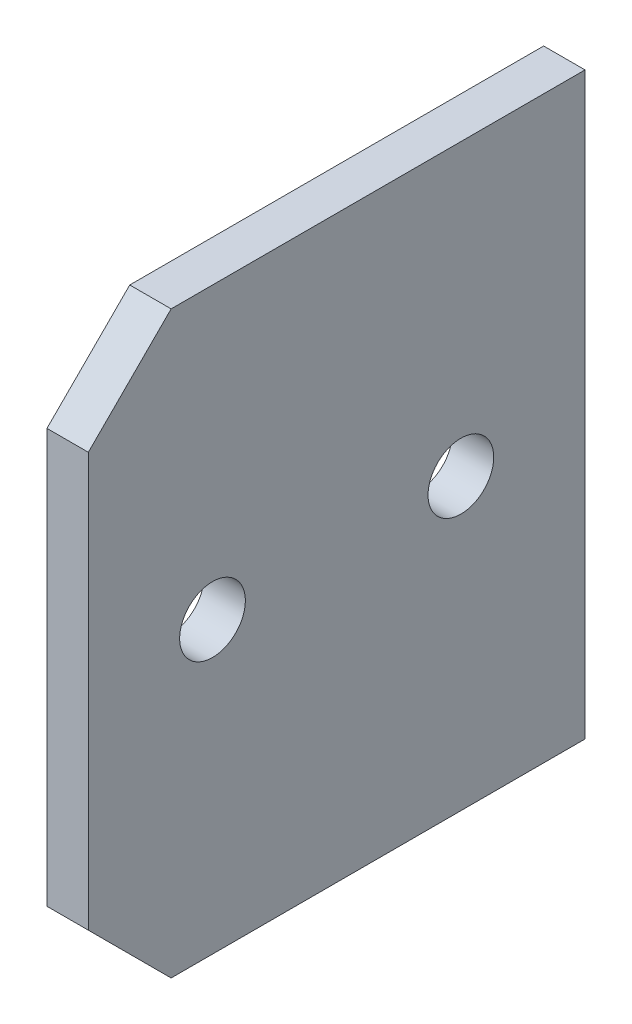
ISO-10303-21;
HEADER;
FILE_DESCRIPTION(('STEP AP214'),'2;1');
FILE_NAME('part.step','',(''),(''),'','','');
FILE_SCHEMA(('AUTOMOTIVE_DESIGN { 1 0 10303 214 1 1 1 1 }'));
ENDSEC;
DATA;
#1=APPLICATION_CONTEXT('core data for automotive mechanical design processes');
#2=APPLICATION_PROTOCOL_DEFINITION('international standard','automotive_design',2000,#1);
#3=PRODUCT_CONTEXT('',#1,'mechanical');
#4=PRODUCT('Part','Part','',(#3));
#5=PRODUCT_RELATED_PRODUCT_CATEGORY('part','',(#4));
#6=PRODUCT_DEFINITION_FORMATION('','',#4);
#7=PRODUCT_DEFINITION_CONTEXT('part definition',#1,'design');
#8=PRODUCT_DEFINITION('design','',#6,#7);
#9=PRODUCT_DEFINITION_SHAPE('','',#8);
#10=(LENGTH_UNIT() NAMED_UNIT(*) SI_UNIT(.MILLI.,.METRE.));
#11=(NAMED_UNIT(*) PLANE_ANGLE_UNIT() SI_UNIT($,.RADIAN.));
#12=(NAMED_UNIT(*) SI_UNIT($,.STERADIAN.) SOLID_ANGLE_UNIT());
#13=UNCERTAINTY_MEASURE_WITH_UNIT(LENGTH_MEASURE(1.E-05),#10,'distance_accuracy_value','');
#14=(GEOMETRIC_REPRESENTATION_CONTEXT(3) GLOBAL_UNCERTAINTY_ASSIGNED_CONTEXT((#13)) GLOBAL_UNIT_ASSIGNED_CONTEXT((#10,
#11,#12)) REPRESENTATION_CONTEXT('',''));
#15=CARTESIAN_POINT('',(0.,0.,0.));
#16=DIRECTION('',(0.,0.,1.));
#17=DIRECTION('',(1.,0.,0.));
#18=AXIS2_PLACEMENT_3D('',#15,#16,#17);
#19=CARTESIAN_POINT('',(-3.175,-44.45,76.2));
#20=DIRECTION('',(0.,1.,0.));
#21=DIRECTION('',(-1.,0.,0.));
#22=AXIS2_PLACEMENT_3D('',#19,#20,#21);
#23=PLANE('',#22);
#24=DIRECTION('',(0.,0.,-1.));
#25=VECTOR('',#24,1.);
#26=CARTESIAN_POINT('',(3.175,-44.45,76.2));
#27=LINE('',#26,#25);
#28=CARTESIAN_POINT('',(3.175,-44.45,63.4999999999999));
#29=VERTEX_POINT('',#28);
#30=CARTESIAN_POINT('',(3.175,-44.45,0.));
#31=VERTEX_POINT('',#30);
#32=EDGE_CURVE('E81',#29,#31,#27,.T.);
#33=ORIENTED_EDGE('',*,*,#32,.F.);
#34=DIRECTION('',(-1.,0.,0.));
#35=VECTOR('',#34,1.);
#36=CARTESIAN_POINT('',(-3.175,-44.45,63.4999999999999));
#37=LINE('',#36,#35);
#38=CARTESIAN_POINT('',(-3.175,-44.45,63.4999999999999));
#39=VERTEX_POINT('',#38);
#40=EDGE_CURVE('E11',#29,#39,#37,.T.);
#41=ORIENTED_EDGE('',*,*,#40,.T.);
#42=DIRECTION('',(0.,0.,-1.));
#43=VECTOR('',#42,1.);
#44=CARTESIAN_POINT('',(-3.175,-44.45,76.2));
#45=LINE('',#44,#43);
#46=CARTESIAN_POINT('',(-3.175,-44.45,0.));
#47=VERTEX_POINT('',#46);
#48=EDGE_CURVE('E101',#39,#47,#45,.T.);
#49=ORIENTED_EDGE('',*,*,#48,.T.);
#50=DIRECTION('',(1.,0.,0.));
#51=VECTOR('',#50,1.);
#52=CARTESIAN_POINT('',(-3.175,-44.45,0.));
#53=LINE('',#52,#51);
#54=EDGE_CURVE('E96',#47,#31,#53,.T.);
#55=ORIENTED_EDGE('',*,*,#54,.T.);
#56=EDGE_LOOP('',(#33,#41,#49,#55));
#57=FACE_BOUND('',#56,.T.);
#58=ADVANCED_FACE('F31',(#57),#23,.F.);
#59=CARTESIAN_POINT('',(3.175,-44.45,76.2));
#60=DIRECTION('',(-1.,0.,0.));
#61=DIRECTION('',(0.,0.,1.));
#62=AXIS2_PLACEMENT_3D('',#59,#60,#61);
#63=PLANE('',#62);
#64=CARTESIAN_POINT('',(3.175,0.,57.1500000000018));
#65=DIRECTION('',(1.,0.,0.));
#66=DIRECTION('',(0.,0.,-1.));
#67=AXIS2_PLACEMENT_3D('',#64,#65,#66);
#68=CIRCLE('',#67,5.0419);
#69=CARTESIAN_POINT('',(3.175,0.,52.1081000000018));
#70=VERTEX_POINT('',#69);
#71=EDGE_CURVE('E186',#70,#70,#68,.T.);
#72=ORIENTED_EDGE('',*,*,#71,.F.);
#73=EDGE_LOOP('',(#72));
#74=FACE_BOUND('',#73,.T.);
#75=CARTESIAN_POINT('',(3.175,0.,19.0500000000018));
#76=DIRECTION('',(1.,0.,0.));
#77=DIRECTION('',(0.,0.,-1.));
#78=AXIS2_PLACEMENT_3D('',#75,#76,#77);
#79=CIRCLE('',#78,5.0419);
#80=CARTESIAN_POINT('',(3.175,0.,14.0081000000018));
#81=VERTEX_POINT('',#80);
#82=EDGE_CURVE('E106',#81,#81,#79,.T.);
#83=ORIENTED_EDGE('',*,*,#82,.F.);
#84=EDGE_LOOP('',(#83));
#85=FACE_BOUND('',#84,.T.);
#86=DIRECTION('',(0.,0.,-1.));
#87=VECTOR('',#86,1.);
#88=CARTESIAN_POINT('',(3.175,44.45,76.2));
#89=LINE('',#88,#87);
#90=CARTESIAN_POINT('',(3.175,44.45,63.4999999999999));
#91=VERTEX_POINT('',#90);
#92=CARTESIAN_POINT('',(3.175,44.45,0.));
#93=VERTEX_POINT('',#92);
#94=EDGE_CURVE('E90',#91,#93,#89,.T.);
#95=ORIENTED_EDGE('',*,*,#94,.F.);
#96=DIRECTION('',(0.,-0.707106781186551,0.707106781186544));
#97=VECTOR('',#96,1.);
#98=CARTESIAN_POINT('',(3.175,31.7499999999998,76.2));
#99=LINE('',#98,#97);
#100=CARTESIAN_POINT('',(3.175,31.7499999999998,76.2));
#101=VERTEX_POINT('',#100);
#102=EDGE_CURVE('E38',#91,#101,#99,.T.);
#103=ORIENTED_EDGE('',*,*,#102,.T.);
#104=DIRECTION('',(0.,1.,0.));
#105=VECTOR('',#104,1.);
#106=CARTESIAN_POINT('',(3.175,-44.45,76.2));
#107=LINE('',#106,#105);
#108=CARTESIAN_POINT('',(3.175,-31.7499999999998,76.2));
#109=VERTEX_POINT('',#108);
#110=EDGE_CURVE('E113',#109,#101,#107,.T.);
#111=ORIENTED_EDGE('',*,*,#110,.F.);
#112=DIRECTION('',(0.,-0.707106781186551,-0.707106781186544));
#113=VECTOR('',#112,1.);
#114=CARTESIAN_POINT('',(3.175,-31.7499999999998,76.2));
#115=LINE('',#114,#113);
#116=EDGE_CURVE('E45',#109,#29,#115,.T.);
#117=ORIENTED_EDGE('',*,*,#116,.T.);
#118=ORIENTED_EDGE('',*,*,#32,.T.);
#119=DIRECTION('',(0.,1.,0.));
#120=VECTOR('',#119,1.);
#121=CARTESIAN_POINT('',(3.175,-44.45,0.));
#122=LINE('',#121,#120);
#123=EDGE_CURVE('E84',#31,#93,#122,.T.);
#124=ORIENTED_EDGE('',*,*,#123,.T.);
#125=EDGE_LOOP('',(#95,#103,#111,#117,#118,#124));
#126=FACE_BOUND('',#125,.T.);
#127=ADVANCED_FACE('F83',(#74,#85,#126),#63,.F.);
#128=CARTESIAN_POINT('',(-3.175,44.45,76.2));
#129=DIRECTION('',(0.,-1.,0.));
#130=DIRECTION('',(1.,0.,0.));
#131=AXIS2_PLACEMENT_3D('',#128,#129,#130);
#132=PLANE('',#131);
#133=DIRECTION('',(0.,0.,-1.));
#134=VECTOR('',#133,1.);
#135=CARTESIAN_POINT('',(-3.175,44.45,76.2));
#136=LINE('',#135,#134);
#137=CARTESIAN_POINT('',(-3.175,44.45,63.4999999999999));
#138=VERTEX_POINT('',#137);
#139=CARTESIAN_POINT('',(-3.175,44.45,0.));
#140=VERTEX_POINT('',#139);
#141=EDGE_CURVE('E120',#138,#140,#136,.T.);
#142=ORIENTED_EDGE('',*,*,#141,.F.);
#143=DIRECTION('',(1.,0.,0.));
#144=VECTOR('',#143,1.);
#145=CARTESIAN_POINT('',(3.175,44.45,63.4999999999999));
#146=LINE('',#145,#144);
#147=EDGE_CURVE('E53',#138,#91,#146,.T.);
#148=ORIENTED_EDGE('',*,*,#147,.T.);
#149=ORIENTED_EDGE('',*,*,#94,.T.);
#150=DIRECTION('',(-1.,0.,0.));
#151=VECTOR('',#150,1.);
#152=CARTESIAN_POINT('',(-3.175,44.45,0.));
#153=LINE('',#152,#151);
#154=EDGE_CURVE('E98',#93,#140,#153,.T.);
#155=ORIENTED_EDGE('',*,*,#154,.T.);
#156=EDGE_LOOP('',(#142,#148,#149,#155));
#157=FACE_BOUND('',#156,.T.);
#158=ADVANCED_FACE('F143',(#157),#132,.F.);
#159=CARTESIAN_POINT('',(-3.175,-44.45,76.2));
#160=DIRECTION('',(1.,0.,0.));
#161=DIRECTION('',(0.,0.,-1.));
#162=AXIS2_PLACEMENT_3D('',#159,#160,#161);
#163=PLANE('',#162);
#164=CARTESIAN_POINT('',(-3.175,0.,57.1500000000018));
#165=DIRECTION('',(1.,0.,0.));
#166=DIRECTION('',(0.,0.,-1.));
#167=AXIS2_PLACEMENT_3D('',#164,#165,#166);
#168=CIRCLE('',#167,5.0419);
#169=CARTESIAN_POINT('',(-3.175,0.,52.1081000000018));
#170=VERTEX_POINT('',#169);
#171=EDGE_CURVE('E184',#170,#170,#168,.T.);
#172=ORIENTED_EDGE('',*,*,#171,.T.);
#173=EDGE_LOOP('',(#172));
#174=FACE_BOUND('',#173,.T.);
#175=CARTESIAN_POINT('',(-3.175,0.,19.0500000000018));
#176=DIRECTION('',(1.,0.,0.));
#177=DIRECTION('',(0.,0.,-1.));
#178=AXIS2_PLACEMENT_3D('',#175,#176,#177);
#179=CIRCLE('',#178,5.0419);
#180=CARTESIAN_POINT('',(-3.175,0.,14.0081000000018));
#181=VERTEX_POINT('',#180);
#182=EDGE_CURVE('E103',#181,#181,#179,.T.);
#183=ORIENTED_EDGE('',*,*,#182,.T.);
#184=EDGE_LOOP('',(#183));
#185=FACE_BOUND('',#184,.T.);
#186=DIRECTION('',(0.,-1.,0.));
#187=VECTOR('',#186,1.);
#188=CARTESIAN_POINT('',(-3.175,-44.45,76.2));
#189=LINE('',#188,#187);
#190=CARTESIAN_POINT('',(-3.175,31.7499999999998,76.2));
#191=VERTEX_POINT('',#190);
#192=CARTESIAN_POINT('',(-3.175,-31.7499999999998,76.2));
#193=VERTEX_POINT('',#192);
#194=EDGE_CURVE('E116',#191,#193,#189,.T.);
#195=ORIENTED_EDGE('',*,*,#194,.F.);
#196=DIRECTION('',(0.,0.707106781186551,-0.707106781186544));
#197=VECTOR('',#196,1.);
#198=CARTESIAN_POINT('',(-3.175,31.7499999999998,76.2));
#199=LINE('',#198,#197);
#200=EDGE_CURVE('E130',#191,#138,#199,.T.);
#201=ORIENTED_EDGE('',*,*,#200,.T.);
#202=ORIENTED_EDGE('',*,*,#141,.T.);
#203=DIRECTION('',(0.,-1.,0.));
#204=VECTOR('',#203,1.);
#205=CARTESIAN_POINT('',(-3.175,-44.45,0.));
#206=LINE('',#205,#204);
#207=EDGE_CURVE('E111',#140,#47,#206,.T.);
#208=ORIENTED_EDGE('',*,*,#207,.T.);
#209=ORIENTED_EDGE('',*,*,#48,.F.);
#210=DIRECTION('',(0.,0.707106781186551,0.707106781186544));
#211=VECTOR('',#210,1.);
#212=CARTESIAN_POINT('',(-3.175,-31.7499999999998,76.2));
#213=LINE('',#212,#211);
#214=EDGE_CURVE('E128',#39,#193,#213,.T.);
#215=ORIENTED_EDGE('',*,*,#214,.T.);
#216=EDGE_LOOP('',(#195,#201,#202,#208,#209,#215));
#217=FACE_BOUND('',#216,.T.);
#218=ADVANCED_FACE('F142',(#174,#185,#217),#163,.F.);
#219=CARTESIAN_POINT('',(3.175,-44.45,76.2));
#220=DIRECTION('',(0.,0.,1.));
#221=DIRECTION('',(1.,0.,0.));
#222=AXIS2_PLACEMENT_3D('',#219,#220,#221);
#223=PLANE('',#222);
#224=ORIENTED_EDGE('',*,*,#110,.T.);
#225=DIRECTION('',(-1.,0.,0.));
#226=VECTOR('',#225,1.);
#227=CARTESIAN_POINT('',(-3.17499999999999,31.7499999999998,76.2));
#228=LINE('',#227,#226);
#229=EDGE_CURVE('E125',#101,#191,#228,.T.);
#230=ORIENTED_EDGE('',*,*,#229,.T.);
#231=ORIENTED_EDGE('',*,*,#194,.T.);
#232=DIRECTION('',(1.,0.,0.));
#233=VECTOR('',#232,1.);
#234=CARTESIAN_POINT('',(3.17500000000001,-31.7499999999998,76.2));
#235=LINE('',#234,#233);
#236=EDGE_CURVE('E89',#193,#109,#235,.T.);
#237=ORIENTED_EDGE('',*,*,#236,.T.);
#238=EDGE_LOOP('',(#224,#230,#231,#237));
#239=FACE_BOUND('',#238,.T.);
#240=ADVANCED_FACE('F137',(#239),#223,.T.);
#241=CARTESIAN_POINT('',(3.175,-44.45,0.));
#242=DIRECTION('',(0.,0.,1.));
#243=DIRECTION('',(1.,0.,0.));
#244=AXIS2_PLACEMENT_3D('',#241,#242,#243);
#245=PLANE('',#244);
#246=ORIENTED_EDGE('',*,*,#54,.F.);
#247=ORIENTED_EDGE('',*,*,#207,.F.);
#248=ORIENTED_EDGE('',*,*,#154,.F.);
#249=ORIENTED_EDGE('',*,*,#123,.F.);
#250=EDGE_LOOP('',(#246,#247,#248,#249));
#251=FACE_BOUND('',#250,.T.);
#252=ADVANCED_FACE('F94',(#251),#245,.F.);
#253=CARTESIAN_POINT('',(-3.175,0.,19.0500000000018));
#254=DIRECTION('',(1.,0.,0.));
#255=DIRECTION('',(0.,0.,-1.));
#256=AXIS2_PLACEMENT_3D('',#253,#254,#255);
#257=CYLINDRICAL_SURFACE('',#256,5.0419);
#258=ORIENTED_EDGE('',*,*,#182,.F.);
#259=EDGE_LOOP('',(#258));
#260=FACE_BOUND('',#259,.T.);
#261=ORIENTED_EDGE('',*,*,#82,.T.);
#262=EDGE_LOOP('',(#261));
#263=FACE_BOUND('',#262,.T.);
#264=ADVANCED_FACE('F174',(#260,#263),#257,.F.);
#265=CARTESIAN_POINT('',(-3.175,0.,57.1500000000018));
#266=DIRECTION('',(1.,0.,0.));
#267=DIRECTION('',(0.,0.,-1.));
#268=AXIS2_PLACEMENT_3D('',#265,#266,#267);
#269=CYLINDRICAL_SURFACE('',#268,5.0419);
#270=ORIENTED_EDGE('',*,*,#171,.F.);
#271=EDGE_LOOP('',(#270));
#272=FACE_BOUND('',#271,.T.);
#273=ORIENTED_EDGE('',*,*,#71,.T.);
#274=EDGE_LOOP('',(#273));
#275=FACE_BOUND('',#274,.T.);
#276=ADVANCED_FACE('F152',(#272,#275),#269,.F.);
#277=CARTESIAN_POINT('',(3.17499999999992,31.7499999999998,76.2));
#278=DIRECTION('',(0.,0.707106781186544,0.707106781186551));
#279=DIRECTION('',(0.,-0.707106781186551,0.707106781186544));
#280=AXIS2_PLACEMENT_3D('',#277,#278,#279);
#281=PLANE('',#280);
#282=ORIENTED_EDGE('',*,*,#102,.F.);
#283=ORIENTED_EDGE('',*,*,#147,.F.);
#284=ORIENTED_EDGE('',*,*,#200,.F.);
#285=ORIENTED_EDGE('',*,*,#229,.F.);
#286=EDGE_LOOP('',(#282,#283,#284,#285));
#287=FACE_BOUND('',#286,.T.);
#288=ADVANCED_FACE('F140',(#287),#281,.T.);
#289=CARTESIAN_POINT('',(3.17500000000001,-31.7499999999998,76.2));
#290=DIRECTION('',(0.,-0.707106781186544,0.707106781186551));
#291=DIRECTION('',(0.,-0.707106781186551,-0.707106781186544));
#292=AXIS2_PLACEMENT_3D('',#289,#290,#291);
#293=PLANE('',#292);
#294=ORIENTED_EDGE('',*,*,#214,.F.);
#295=ORIENTED_EDGE('',*,*,#40,.F.);
#296=ORIENTED_EDGE('',*,*,#116,.F.);
#297=ORIENTED_EDGE('',*,*,#236,.F.);
#298=EDGE_LOOP('',(#294,#295,#296,#297));
#299=FACE_BOUND('',#298,.T.);
#300=ADVANCED_FACE('F146',(#299),#293,.T.);
#301=CLOSED_SHELL('',(#58,#127,#158,#218,#240,#252,#264,#276,#288,#300));
#302=MANIFOLD_SOLID_BREP('B2',#301);
#303=ADVANCED_BREP_SHAPE_REPRESENTATION('',(#18,#302),#14);
#304=SHAPE_DEFINITION_REPRESENTATION(#9,#303);
ENDSEC;
END-ISO-10303-21;
